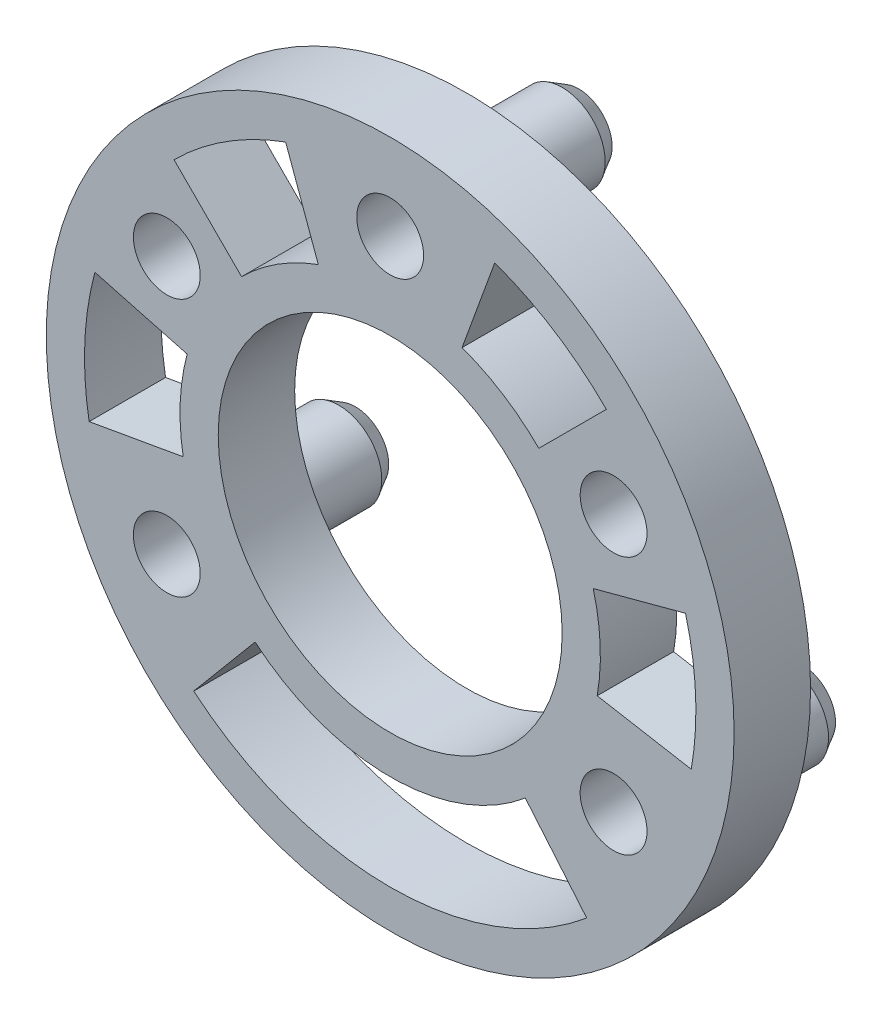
ISO-10303-21;
HEADER;
FILE_DESCRIPTION(('STEP AP214'),'2;1');
FILE_NAME('part.step','',(''),(''),'','','');
FILE_SCHEMA(('AUTOMOTIVE_DESIGN { 1 0 10303 214 1 1 1 1 }'));
ENDSEC;
DATA;
#1=APPLICATION_CONTEXT('core data for automotive mechanical design processes');
#2=APPLICATION_PROTOCOL_DEFINITION('international standard','automotive_design',2000,#1);
#3=PRODUCT_CONTEXT('',#1,'mechanical');
#4=PRODUCT('Part','Part','',(#3));
#5=PRODUCT_RELATED_PRODUCT_CATEGORY('part','',(#4));
#6=PRODUCT_DEFINITION_FORMATION('','',#4);
#7=PRODUCT_DEFINITION_CONTEXT('part definition',#1,'design');
#8=PRODUCT_DEFINITION('design','',#6,#7);
#9=PRODUCT_DEFINITION_SHAPE('','',#8);
#10=(LENGTH_UNIT() NAMED_UNIT(*) SI_UNIT(.MILLI.,.METRE.));
#11=(NAMED_UNIT(*) PLANE_ANGLE_UNIT() SI_UNIT($,.RADIAN.));
#12=(NAMED_UNIT(*) SI_UNIT($,.STERADIAN.) SOLID_ANGLE_UNIT());
#13=UNCERTAINTY_MEASURE_WITH_UNIT(LENGTH_MEASURE(1.E-05),#10,'distance_accuracy_value','');
#14=(GEOMETRIC_REPRESENTATION_CONTEXT(3) GLOBAL_UNCERTAINTY_ASSIGNED_CONTEXT((#13)) GLOBAL_UNIT_ASSIGNED_CONTEXT((#10,
#11,#12)) REPRESENTATION_CONTEXT('',''));
#15=CARTESIAN_POINT('',(0.,0.,0.));
#16=DIRECTION('',(0.,0.,1.));
#17=DIRECTION('',(1.,0.,0.));
#18=AXIS2_PLACEMENT_3D('',#15,#16,#17);
#19=CARTESIAN_POINT('',(0.,0.,4.));
#20=DIRECTION('',(0.,0.,-1.));
#21=DIRECTION('',(-1.,0.,0.));
#22=AXIS2_PLACEMENT_3D('',#19,#20,#21);
#23=CYLINDRICAL_SURFACE('',#22,11.);
#24=CARTESIAN_POINT('',(0.,0.,0.));
#25=DIRECTION('',(0.,0.,-1.));
#26=DIRECTION('',(-1.,0.,0.));
#27=AXIS2_PLACEMENT_3D('',#24,#25,#26);
#28=CIRCLE('',#27,11.);
#29=CARTESIAN_POINT('',(10.6251840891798,2.8470094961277,0.));
#30=VERTEX_POINT('',#29);
#31=CARTESIAN_POINT('',(10.8328852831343,-1.91012995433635,0.));
#32=VERTEX_POINT('',#31);
#33=EDGE_CURVE('E552',#30,#32,#28,.T.);
#34=ORIENTED_EDGE('',*,*,#33,.F.);
#35=DIRECTION('',(0.,0.,1.));
#36=VECTOR('',#35,1.);
#37=CARTESIAN_POINT('',(10.6251840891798,2.8470094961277,-11.4287257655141));
#38=LINE('',#37,#36);
#39=CARTESIAN_POINT('',(10.6251840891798,2.8470094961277,4.));
#40=VERTEX_POINT('',#39);
#41=EDGE_CURVE('E61',#30,#40,#38,.T.);
#42=ORIENTED_EDGE('',*,*,#41,.T.);
#43=CARTESIAN_POINT('',(0.,0.,4.));
#44=DIRECTION('',(0.,0.,-1.));
#45=DIRECTION('',(-1.,0.,0.));
#46=AXIS2_PLACEMENT_3D('',#43,#44,#45);
#47=CIRCLE('',#46,11.);
#48=CARTESIAN_POINT('',(10.8328852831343,-1.91012995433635,4.));
#49=VERTEX_POINT('',#48);
#50=EDGE_CURVE('E213',#40,#49,#47,.T.);
#51=ORIENTED_EDGE('',*,*,#50,.T.);
#52=DIRECTION('',(0.,0.,-1.));
#53=VECTOR('',#52,1.);
#54=CARTESIAN_POINT('',(10.8328852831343,-1.91012995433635,4.));
#55=LINE('',#54,#53);
#56=EDGE_CURVE('E230',#49,#32,#55,.T.);
#57=ORIENTED_EDGE('',*,*,#56,.T.);
#58=EDGE_LOOP('',(#34,#42,#51,#57));
#59=FACE_BOUND('',#58,.T.);
#60=ADVANCED_FACE('F44',(#59),#23,.T.);
#61=CARTESIAN_POINT('',(3.76222157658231,10.336618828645,4.));
#62=VERTEX_POINT('',#61);
#63=CARTESIAN_POINT('',(7.77817459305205,7.77817459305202,4.));
#64=VERTEX_POINT('',#63);
#65=EDGE_CURVE('E553',#62,#64,#47,.T.);
#66=ORIENTED_EDGE('',*,*,#65,.T.);
#67=DIRECTION('',(0.,0.,1.));
#68=VECTOR('',#67,1.);
#69=CARTESIAN_POINT('',(7.77817459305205,7.77817459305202,-11.4287257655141));
#70=LINE('',#69,#68);
#71=CARTESIAN_POINT('',(7.77817459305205,7.77817459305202,0.));
#72=VERTEX_POINT('',#71);
#73=EDGE_CURVE('E467',#72,#64,#70,.T.);
#74=ORIENTED_EDGE('',*,*,#73,.F.);
#75=CARTESIAN_POINT('',(3.76222157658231,10.336618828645,0.));
#76=VERTEX_POINT('',#75);
#77=EDGE_CURVE('E563',#76,#72,#28,.T.);
#78=ORIENTED_EDGE('',*,*,#77,.F.);
#79=DIRECTION('',(0.,0.,-1.));
#80=VECTOR('',#79,1.);
#81=CARTESIAN_POINT('',(3.76222157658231,10.336618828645,4.));
#82=LINE('',#81,#80);
#83=EDGE_CURVE('E218',#62,#76,#82,.T.);
#84=ORIENTED_EDGE('',*,*,#83,.F.);
#85=EDGE_LOOP('',(#66,#74,#78,#84));
#86=FACE_BOUND('',#85,.T.);
#87=ADVANCED_FACE('F355',(#86),#23,.T.);
#88=CARTESIAN_POINT('',(0.,0.,4.));
#89=DIRECTION('',(0.,0.,-1.));
#90=DIRECTION('',(-1.,0.,0.));
#91=AXIS2_PLACEMENT_3D('',#88,#89,#90);
#92=CYLINDRICAL_SURFACE('',#91,16.);
#93=CARTESIAN_POINT('',(0.,0.,4.));
#94=DIRECTION('',(0.,0.,1.));
#95=DIRECTION('',(-1.,0.,0.));
#96=AXIS2_PLACEMENT_3D('',#93,#94,#95);
#97=CIRCLE('',#96,16.);
#98=CARTESIAN_POINT('',(15.7569240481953,-2.77837084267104,4.));
#99=VERTEX_POINT('',#98);
#100=CARTESIAN_POINT('',(15.4548132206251,4.14110472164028,4.));
#101=VERTEX_POINT('',#100);
#102=EDGE_CURVE('E198',#99,#101,#97,.T.);
#103=ORIENTED_EDGE('',*,*,#102,.T.);
#104=DIRECTION('',(0.,0.,1.));
#105=VECTOR('',#104,1.);
#106=CARTESIAN_POINT('',(15.4548132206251,4.14110472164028,-11.4287257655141));
#107=LINE('',#106,#105);
#108=CARTESIAN_POINT('',(15.4548132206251,4.14110472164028,0.));
#109=VERTEX_POINT('',#108);
#110=EDGE_CURVE('E183',#109,#101,#107,.T.);
#111=ORIENTED_EDGE('',*,*,#110,.F.);
#112=CARTESIAN_POINT('',(0.,0.,0.));
#113=DIRECTION('',(0.,0.,1.));
#114=DIRECTION('',(-1.,0.,0.));
#115=AXIS2_PLACEMENT_3D('',#112,#113,#114);
#116=CIRCLE('',#115,16.);
#117=CARTESIAN_POINT('',(15.7569240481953,-2.77837084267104,0.));
#118=VERTEX_POINT('',#117);
#119=EDGE_CURVE('E195',#118,#109,#116,.T.);
#120=ORIENTED_EDGE('',*,*,#119,.F.);
#121=DIRECTION('',(0.,0.,-1.));
#122=VECTOR('',#121,1.);
#123=CARTESIAN_POINT('',(15.7569240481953,-2.77837084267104,4.));
#124=LINE('',#123,#122);
#125=EDGE_CURVE('E227',#99,#118,#124,.T.);
#126=ORIENTED_EDGE('',*,*,#125,.F.);
#127=EDGE_LOOP('',(#103,#111,#120,#126));
#128=FACE_BOUND('',#127,.T.);
#129=ADVANCED_FACE('F193',(#128),#92,.F.);
#130=CARTESIAN_POINT('',(11.3137084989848,11.3137084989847,0.));
#131=VERTEX_POINT('',#130);
#132=CARTESIAN_POINT('',(5.47232229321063,15.0350819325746,0.));
#133=VERTEX_POINT('',#132);
#134=EDGE_CURVE('E208',#131,#133,#116,.T.);
#135=ORIENTED_EDGE('',*,*,#134,.F.);
#136=DIRECTION('',(0.,0.,1.));
#137=VECTOR('',#136,1.);
#138=CARTESIAN_POINT('',(11.3137084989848,11.3137084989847,-11.4287257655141));
#139=LINE('',#138,#137);
#140=CARTESIAN_POINT('',(11.3137084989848,11.3137084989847,4.));
#141=VERTEX_POINT('',#140);
#142=EDGE_CURVE('E69',#131,#141,#139,.T.);
#143=ORIENTED_EDGE('',*,*,#142,.T.);
#144=CARTESIAN_POINT('',(5.47232229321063,15.0350819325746,4.));
#145=VERTEX_POINT('',#144);
#146=EDGE_CURVE('E559',#141,#145,#97,.T.);
#147=ORIENTED_EDGE('',*,*,#146,.T.);
#148=DIRECTION('',(0.,0.,-1.));
#149=VECTOR('',#148,1.);
#150=CARTESIAN_POINT('',(5.47232229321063,15.0350819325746,4.));
#151=LINE('',#150,#149);
#152=EDGE_CURVE('E222',#145,#133,#151,.T.);
#153=ORIENTED_EDGE('',*,*,#152,.T.);
#154=EDGE_LOOP('',(#135,#143,#147,#153));
#155=FACE_BOUND('',#154,.T.);
#156=ADVANCED_FACE('F632',(#155),#92,.F.);
#157=CARTESIAN_POINT('',(0.,0.,4.));
#158=DIRECTION('',(0.,0.,-1.));
#159=DIRECTION('',(-1.,0.,0.));
#160=AXIS2_PLACEMENT_3D('',#157,#158,#159);
#161=CYLINDRICAL_SURFACE('',#160,11.);
#162=DIRECTION('',(0.,0.,1.));
#163=VECTOR('',#162,1.);
#164=CARTESIAN_POINT('',(-10.6251840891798,2.8470094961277,-11.4287257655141));
#165=LINE('',#164,#163);
#166=CARTESIAN_POINT('',(-10.6251840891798,2.8470094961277,0.));
#167=VERTEX_POINT('',#166);
#168=CARTESIAN_POINT('',(-10.6251840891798,2.8470094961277,4.));
#169=VERTEX_POINT('',#168);
#170=EDGE_CURVE('E501',#167,#169,#165,.T.);
#171=ORIENTED_EDGE('',*,*,#170,.F.);
#172=CARTESIAN_POINT('',(0.,0.,0.));
#173=DIRECTION('',(0.,0.,-1.));
#174=DIRECTION('',(-1.,0.,0.));
#175=AXIS2_PLACEMENT_3D('',#172,#173,#174);
#176=CIRCLE('',#175,11.);
#177=CARTESIAN_POINT('',(-10.8328852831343,-1.91012995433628,0.));
#178=VERTEX_POINT('',#177);
#179=EDGE_CURVE('E252',#178,#167,#176,.T.);
#180=ORIENTED_EDGE('',*,*,#179,.F.);
#181=DIRECTION('',(0.,0.,-1.));
#182=VECTOR('',#181,1.);
#183=CARTESIAN_POINT('',(-10.8328852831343,-1.91012995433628,4.));
#184=LINE('',#183,#182);
#185=CARTESIAN_POINT('',(-10.8328852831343,-1.91012995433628,4.));
#186=VERTEX_POINT('',#185);
#187=EDGE_CURVE('E251',#186,#178,#184,.T.);
#188=ORIENTED_EDGE('',*,*,#187,.F.);
#189=CARTESIAN_POINT('',(0.,0.,4.));
#190=DIRECTION('',(0.,0.,-1.));
#191=DIRECTION('',(-1.,0.,0.));
#192=AXIS2_PLACEMENT_3D('',#189,#190,#191);
#193=CIRCLE('',#192,11.);
#194=EDGE_CURVE('E235',#186,#169,#193,.T.);
#195=ORIENTED_EDGE('',*,*,#194,.T.);
#196=EDGE_LOOP('',(#171,#180,#188,#195));
#197=FACE_BOUND('',#196,.T.);
#198=ADVANCED_FACE('F384',(#197),#161,.T.);
#199=CARTESIAN_POINT('',(0.,0.,4.));
#200=DIRECTION('',(0.,0.,-1.));
#201=DIRECTION('',(-1.,0.,0.));
#202=AXIS2_PLACEMENT_3D('',#199,#200,#201);
#203=CYLINDRICAL_SURFACE('',#202,16.);
#204=DIRECTION('',(0.,0.,1.));
#205=VECTOR('',#204,1.);
#206=CARTESIAN_POINT('',(-15.4548132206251,4.14110472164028,-11.4287257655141));
#207=LINE('',#206,#205);
#208=CARTESIAN_POINT('',(-15.4548132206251,4.14110472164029,0.));
#209=VERTEX_POINT('',#208);
#210=CARTESIAN_POINT('',(-15.4548132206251,4.14110472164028,4.));
#211=VERTEX_POINT('',#210);
#212=EDGE_CURVE('E494',#209,#211,#207,.T.);
#213=ORIENTED_EDGE('',*,*,#212,.T.);
#214=CARTESIAN_POINT('',(0.,0.,4.));
#215=DIRECTION('',(0.,0.,1.));
#216=DIRECTION('',(-1.,0.,0.));
#217=AXIS2_PLACEMENT_3D('',#214,#215,#216);
#218=CIRCLE('',#217,16.);
#219=CARTESIAN_POINT('',(-15.7569240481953,-2.77837084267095,4.));
#220=VERTEX_POINT('',#219);
#221=EDGE_CURVE('E243',#211,#220,#218,.T.);
#222=ORIENTED_EDGE('',*,*,#221,.T.);
#223=DIRECTION('',(0.,0.,-1.));
#224=VECTOR('',#223,1.);
#225=CARTESIAN_POINT('',(-15.7569240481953,-2.77837084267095,4.));
#226=LINE('',#225,#224);
#227=CARTESIAN_POINT('',(-15.7569240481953,-2.77837084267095,0.));
#228=VERTEX_POINT('',#227);
#229=EDGE_CURVE('E272',#220,#228,#226,.T.);
#230=ORIENTED_EDGE('',*,*,#229,.T.);
#231=CARTESIAN_POINT('',(0.,0.,0.));
#232=DIRECTION('',(0.,0.,1.));
#233=DIRECTION('',(-1.,0.,0.));
#234=AXIS2_PLACEMENT_3D('',#231,#232,#233);
#235=CIRCLE('',#234,16.);
#236=EDGE_CURVE('E260',#209,#228,#235,.T.);
#237=ORIENTED_EDGE('',*,*,#236,.F.);
#238=EDGE_LOOP('',(#213,#222,#230,#237));
#239=FACE_BOUND('',#238,.T.);
#240=ADVANCED_FACE('F375',(#239),#203,.F.);
#241=CARTESIAN_POINT('',(0.,0.,0.));
#242=DIRECTION('',(0.,0.,1.));
#243=DIRECTION('',(1.,0.,0.));
#244=AXIS2_PLACEMENT_3D('',#241,#242,#243);
#245=PLANE('',#244);
#246=DIRECTION('',(0.965925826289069,0.258819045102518,0.));
#247=VECTOR('',#246,1.);
#248=CARTESIAN_POINT('',(15.4548132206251,4.14110472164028,0.));
#249=LINE('',#248,#247);
#250=EDGE_CURVE('E180',#30,#109,#249,.T.);
#251=ORIENTED_EDGE('',*,*,#250,.F.);
#252=ORIENTED_EDGE('',*,*,#33,.T.);
#253=DIRECTION('',(0.984807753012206,-0.173648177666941,0.));
#254=VECTOR('',#253,1.);
#255=CARTESIAN_POINT('',(15.7569240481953,-2.77837084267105,0.));
#256=LINE('',#255,#254);
#257=EDGE_CURVE('E205',#32,#118,#256,.T.);
#258=ORIENTED_EDGE('',*,*,#257,.T.);
#259=ORIENTED_EDGE('',*,*,#119,.T.);
#260=EDGE_LOOP('',(#251,#252,#258,#259));
#261=FACE_BOUND('',#260,.T.);
#262=ORIENTED_EDGE('',*,*,#179,.T.);
#263=DIRECTION('',(-0.965925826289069,0.258819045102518,0.));
#264=VECTOR('',#263,1.);
#265=CARTESIAN_POINT('',(-15.4548132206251,4.14110472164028,0.));
#266=LINE('',#265,#264);
#267=EDGE_CURVE('E476',#167,#209,#266,.T.);
#268=ORIENTED_EDGE('',*,*,#267,.T.);
#269=ORIENTED_EDGE('',*,*,#236,.T.);
#270=DIRECTION('',(0.984807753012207,0.173648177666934,0.));
#271=VECTOR('',#270,1.);
#272=CARTESIAN_POINT('',(-10.8328852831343,-1.91012995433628,0.));
#273=LINE('',#272,#271);
#274=EDGE_CURVE('E265',#228,#178,#273,.T.);
#275=ORIENTED_EDGE('',*,*,#274,.T.);
#276=EDGE_LOOP('',(#262,#268,#269,#275));
#277=FACE_BOUND('',#276,.T.);
#278=CARTESIAN_POINT('',(11.6913429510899,-6.75000000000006,0.));
#279=DIRECTION('',(0.,0.,1.));
#280=DIRECTION('',(1.,0.,0.));
#281=AXIS2_PLACEMENT_3D('',#278,#279,#280);
#282=CIRCLE('',#281,2.25);
#283=CARTESIAN_POINT('',(13.9413429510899,-6.75000000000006,0.));
#284=VERTEX_POINT('',#283);
#285=EDGE_CURVE('E315',#284,#284,#282,.F.);
#286=ORIENTED_EDGE('',*,*,#285,.F.);
#287=EDGE_LOOP('',(#286));
#288=FACE_BOUND('',#287,.T.);
#289=CARTESIAN_POINT('',(0.,0.,0.));
#290=DIRECTION('',(0.,0.,-1.));
#291=DIRECTION('',(-1.,0.,0.));
#292=AXIS2_PLACEMENT_3D('',#289,#290,#291);
#293=CIRCLE('',#292,11.);
#294=CARTESIAN_POINT('',(7.07066370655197,-8.42648887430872,0.));
#295=VERTEX_POINT('',#294);
#296=CARTESIAN_POINT('',(-7.07066370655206,-8.42648887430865,0.));
#297=VERTEX_POINT('',#296);
#298=EDGE_CURVE('E510',#295,#297,#293,.T.);
#299=ORIENTED_EDGE('',*,*,#298,.T.);
#300=DIRECTION('',(-0.642787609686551,-0.766044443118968,0.));
#301=VECTOR('',#300,1.);
#302=CARTESIAN_POINT('',(-10.2846017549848,-12.2567110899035,0.));
#303=LINE('',#302,#301);
#304=CARTESIAN_POINT('',(-10.2846017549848,-12.2567110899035,0.));
#305=VERTEX_POINT('',#304);
#306=EDGE_CURVE('E528',#297,#305,#303,.T.);
#307=ORIENTED_EDGE('',*,*,#306,.T.);
#308=CARTESIAN_POINT('',(0.,0.,0.));
#309=DIRECTION('',(0.,0.,1.));
#310=DIRECTION('',(-1.,0.,0.));
#311=AXIS2_PLACEMENT_3D('',#308,#309,#310);
#312=CIRCLE('',#311,16.);
#313=CARTESIAN_POINT('',(10.2846017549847,-12.2567110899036,0.));
#314=VERTEX_POINT('',#313);
#315=EDGE_CURVE('E532',#305,#314,#312,.T.);
#316=ORIENTED_EDGE('',*,*,#315,.T.);
#317=DIRECTION('',(-0.642787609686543,0.766044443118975,0.));
#318=VECTOR('',#317,1.);
#319=CARTESIAN_POINT('',(7.07066370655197,-8.42648887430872,0.));
#320=LINE('',#319,#318);
#321=EDGE_CURVE('E514',#314,#295,#320,.T.);
#322=ORIENTED_EDGE('',*,*,#321,.T.);
#323=EDGE_LOOP('',(#299,#307,#316,#322));
#324=FACE_BOUND('',#323,.T.);
#325=DIRECTION('',(0.707106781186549,-0.707106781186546,0.));
#326=VECTOR('',#325,1.);
#327=CARTESIAN_POINT('',(-11.3137084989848,11.3137084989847,0.));
#328=LINE('',#327,#326);
#329=CARTESIAN_POINT('',(-11.3137084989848,11.3137084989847,0.));
#330=VERTEX_POINT('',#329);
#331=CARTESIAN_POINT('',(-7.77817459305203,7.778174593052,0.));
#332=VERTEX_POINT('',#331);
#333=EDGE_CURVE('E481',#330,#332,#328,.T.);
#334=ORIENTED_EDGE('',*,*,#333,.T.);
#335=CARTESIAN_POINT('',(-3.76222157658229,10.336618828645,0.));
#336=VERTEX_POINT('',#335);
#337=EDGE_CURVE('E234',#332,#336,#176,.T.);
#338=ORIENTED_EDGE('',*,*,#337,.T.);
#339=DIRECTION('',(-0.342020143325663,0.93969262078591,0.));
#340=VECTOR('',#339,1.);
#341=CARTESIAN_POINT('',(-5.47232229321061,15.0350819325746,0.));
#342=LINE('',#341,#340);
#343=CARTESIAN_POINT('',(-5.47232229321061,15.0350819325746,0.));
#344=VERTEX_POINT('',#343);
#345=EDGE_CURVE('E256',#336,#344,#342,.T.);
#346=ORIENTED_EDGE('',*,*,#345,.T.);
#347=EDGE_CURVE('E261',#344,#330,#235,.T.);
#348=ORIENTED_EDGE('',*,*,#347,.T.);
#349=EDGE_LOOP('',(#334,#338,#346,#348));
#350=FACE_BOUND('',#349,.T.);
#351=CARTESIAN_POINT('',(0.,0.,0.));
#352=DIRECTION('',(0.,0.,1.));
#353=DIRECTION('',(1.,0.,0.));
#354=AXIS2_PLACEMENT_3D('',#351,#352,#353);
#355=CIRCLE('',#354,18.);
#356=CARTESIAN_POINT('',(18.,0.,0.));
#357=VERTEX_POINT('',#356);
#358=EDGE_CURVE('E303',#357,#357,#355,.T.);
#359=ORIENTED_EDGE('',*,*,#358,.F.);
#360=EDGE_LOOP('',(#359));
#361=FACE_BOUND('',#360,.T.);
#362=CARTESIAN_POINT('',(0.,0.,0.));
#363=DIRECTION('',(0.,0.,1.));
#364=DIRECTION('',(1.,0.,0.));
#365=AXIS2_PLACEMENT_3D('',#362,#363,#364);
#366=CIRCLE('',#365,9.);
#367=CARTESIAN_POINT('',(9.,0.,0.));
#368=VERTEX_POINT('',#367);
#369=EDGE_CURVE('E283',#368,#368,#366,.T.);
#370=ORIENTED_EDGE('',*,*,#369,.T.);
#371=EDGE_LOOP('',(#370));
#372=FACE_BOUND('',#371,.T.);
#373=ORIENTED_EDGE('',*,*,#77,.T.);
#374=DIRECTION('',(-0.707106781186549,-0.707106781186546,0.));
#375=VECTOR('',#374,1.);
#376=CARTESIAN_POINT('',(11.3137084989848,11.3137084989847,0.));
#377=LINE('',#376,#375);
#378=EDGE_CURVE('E466',#131,#72,#377,.T.);
#379=ORIENTED_EDGE('',*,*,#378,.F.);
#380=ORIENTED_EDGE('',*,*,#134,.T.);
#381=DIRECTION('',(-0.342020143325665,-0.93969262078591,0.));
#382=VECTOR('',#381,1.);
#383=CARTESIAN_POINT('',(3.76222157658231,10.336618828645,0.));
#384=LINE('',#383,#382);
#385=EDGE_CURVE('E207',#133,#76,#384,.T.);
#386=ORIENTED_EDGE('',*,*,#385,.T.);
#387=EDGE_LOOP('',(#373,#379,#380,#386));
#388=FACE_BOUND('',#387,.T.);
#389=CARTESIAN_POINT('',(0.,13.5,0.));
#390=DIRECTION('',(0.,0.,1.));
#391=DIRECTION('',(1.,0.,0.));
#392=AXIS2_PLACEMENT_3D('',#389,#390,#391);
#393=CIRCLE('',#392,2.25);
#394=CARTESIAN_POINT('',(2.25,13.5,0.));
#395=VERTEX_POINT('',#394);
#396=EDGE_CURVE('E308',#395,#395,#393,.F.);
#397=ORIENTED_EDGE('',*,*,#396,.F.);
#398=EDGE_LOOP('',(#397));
#399=FACE_BOUND('',#398,.T.);
#400=CARTESIAN_POINT('',(-11.6913429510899,-6.75000000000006,0.));
#401=DIRECTION('',(0.,0.,1.));
#402=DIRECTION('',(1.,0.,0.));
#403=AXIS2_PLACEMENT_3D('',#400,#401,#402);
#404=CIRCLE('',#403,2.25);
#405=CARTESIAN_POINT('',(-9.44134295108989,-6.75000000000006,0.));
#406=VERTEX_POINT('',#405);
#407=EDGE_CURVE('E319',#406,#406,#404,.F.);
#408=ORIENTED_EDGE('',*,*,#407,.F.);
#409=EDGE_LOOP('',(#408));
#410=FACE_BOUND('',#409,.T.);
#411=CARTESIAN_POINT('',(-11.6913429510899,6.74999999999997,0.));
#412=DIRECTION('',(0.,0.,1.));
#413=DIRECTION('',(1.,0.,0.));
#414=AXIS2_PLACEMENT_3D('',#411,#412,#413);
#415=CIRCLE('',#414,1.75);
#416=CARTESIAN_POINT('',(-9.94134295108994,6.74999999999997,0.));
#417=VERTEX_POINT('',#416);
#418=EDGE_CURVE('E480',#417,#417,#415,.F.);
#419=ORIENTED_EDGE('',*,*,#418,.F.);
#420=EDGE_LOOP('',(#419));
#421=FACE_BOUND('',#420,.T.);
#422=CARTESIAN_POINT('',(11.6913429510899,6.74999999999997,0.));
#423=DIRECTION('',(0.,0.,1.));
#424=DIRECTION('',(1.,0.,0.));
#425=AXIS2_PLACEMENT_3D('',#422,#423,#424);
#426=CIRCLE('',#425,1.75);
#427=CARTESIAN_POINT('',(13.4413429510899,6.74999999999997,0.));
#428=VERTEX_POINT('',#427);
#429=EDGE_CURVE('E472',#428,#428,#426,.T.);
#430=ORIENTED_EDGE('',*,*,#429,.T.);
#431=EDGE_LOOP('',(#430));
#432=FACE_BOUND('',#431,.T.);
#433=ADVANCED_FACE('F202',(#261,#277,#288,#324,#350,#361,#372,#388,#399,#410,#421,#432),#245,.F.);
#434=CARTESIAN_POINT('',(0.,0.,4.));
#435=DIRECTION('',(0.,0.,1.));
#436=DIRECTION('',(1.,0.,0.));
#437=AXIS2_PLACEMENT_3D('',#434,#435,#436);
#438=PLANE('',#437);
#439=DIRECTION('',(0.707106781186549,0.707106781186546,0.));
#440=VECTOR('',#439,1.);
#441=CARTESIAN_POINT('',(11.3137084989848,11.3137084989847,4.));
#442=LINE('',#441,#440);
#443=EDGE_CURVE('E461',#64,#141,#442,.T.);
#444=ORIENTED_EDGE('',*,*,#443,.F.);
#445=ORIENTED_EDGE('',*,*,#65,.F.);
#446=DIRECTION('',(-0.342020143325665,-0.93969262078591,0.));
#447=VECTOR('',#446,1.);
#448=CARTESIAN_POINT('',(3.76222157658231,10.336618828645,4.));
#449=LINE('',#448,#447);
#450=EDGE_CURVE('E223',#145,#62,#449,.T.);
#451=ORIENTED_EDGE('',*,*,#450,.F.);
#452=ORIENTED_EDGE('',*,*,#146,.F.);
#453=EDGE_LOOP('',(#444,#445,#451,#452));
#454=FACE_BOUND('',#453,.T.);
#455=CARTESIAN_POINT('',(-7.77817459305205,7.77817459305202,4.));
#456=VERTEX_POINT('',#455);
#457=CARTESIAN_POINT('',(-3.76222157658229,10.336618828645,4.));
#458=VERTEX_POINT('',#457);
#459=EDGE_CURVE('E240',#456,#458,#193,.T.);
#460=ORIENTED_EDGE('',*,*,#459,.F.);
#461=DIRECTION('',(-0.707106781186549,0.707106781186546,0.));
#462=VECTOR('',#461,1.);
#463=CARTESIAN_POINT('',(-11.3137084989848,11.3137084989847,4.));
#464=LINE('',#463,#462);
#465=CARTESIAN_POINT('',(-11.3137084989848,11.3137084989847,4.));
#466=VERTEX_POINT('',#465);
#467=EDGE_CURVE('E490',#456,#466,#464,.T.);
#468=ORIENTED_EDGE('',*,*,#467,.T.);
#469=CARTESIAN_POINT('',(-5.47232229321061,15.0350819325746,4.));
#470=VERTEX_POINT('',#469);
#471=EDGE_CURVE('E244',#470,#466,#218,.T.);
#472=ORIENTED_EDGE('',*,*,#471,.F.);
#473=DIRECTION('',(-0.342020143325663,0.93969262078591,0.));
#474=VECTOR('',#473,1.);
#475=CARTESIAN_POINT('',(-5.47232229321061,15.0350819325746,4.));
#476=LINE('',#475,#474);
#477=EDGE_CURVE('E239',#458,#470,#476,.T.);
#478=ORIENTED_EDGE('',*,*,#477,.F.);
#479=EDGE_LOOP('',(#460,#468,#472,#478));
#480=FACE_BOUND('',#479,.T.);
#481=CARTESIAN_POINT('',(11.6913429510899,-6.75000000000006,4.));
#482=DIRECTION('',(0.,0.,1.));
#483=DIRECTION('',(1.,0.,0.));
#484=AXIS2_PLACEMENT_3D('',#481,#482,#483);
#485=CIRCLE('',#484,1.75);
#486=CARTESIAN_POINT('',(13.4413429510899,-6.75000000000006,4.));
#487=VERTEX_POINT('',#486);
#488=EDGE_CURVE('E288',#487,#487,#485,.T.);
#489=ORIENTED_EDGE('',*,*,#488,.F.);
#490=EDGE_LOOP('',(#489));
#491=FACE_BOUND('',#490,.T.);
#492=CARTESIAN_POINT('',(0.,13.5,4.));
#493=DIRECTION('',(0.,0.,1.));
#494=DIRECTION('',(1.,0.,0.));
#495=AXIS2_PLACEMENT_3D('',#492,#493,#494);
#496=CIRCLE('',#495,1.75);
#497=CARTESIAN_POINT('',(1.75,13.5,4.));
#498=VERTEX_POINT('',#497);
#499=EDGE_CURVE('E299',#498,#498,#496,.T.);
#500=ORIENTED_EDGE('',*,*,#499,.F.);
#501=EDGE_LOOP('',(#500));
#502=FACE_BOUND('',#501,.T.);
#503=CARTESIAN_POINT('',(0.,0.,4.));
#504=DIRECTION('',(0.,0.,1.));
#505=DIRECTION('',(1.,0.,0.));
#506=AXIS2_PLACEMENT_3D('',#503,#504,#505);
#507=CIRCLE('',#506,18.);
#508=CARTESIAN_POINT('',(18.,0.,4.));
#509=VERTEX_POINT('',#508);
#510=EDGE_CURVE('E304',#509,#509,#507,.T.);
#511=ORIENTED_EDGE('',*,*,#510,.T.);
#512=EDGE_LOOP('',(#511));
#513=FACE_BOUND('',#512,.T.);
#514=CARTESIAN_POINT('',(-11.6913429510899,-6.75000000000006,4.));
#515=DIRECTION('',(0.,0.,1.));
#516=DIRECTION('',(1.,0.,0.));
#517=AXIS2_PLACEMENT_3D('',#514,#515,#516);
#518=CIRCLE('',#517,1.75);
#519=CARTESIAN_POINT('',(-9.94134295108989,-6.75000000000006,4.));
#520=VERTEX_POINT('',#519);
#521=EDGE_CURVE('E295',#520,#520,#518,.T.);
#522=ORIENTED_EDGE('',*,*,#521,.F.);
#523=EDGE_LOOP('',(#522));
#524=FACE_BOUND('',#523,.T.);
#525=CARTESIAN_POINT('',(0.,0.,4.));
#526=DIRECTION('',(0.,0.,1.));
#527=DIRECTION('',(1.,0.,0.));
#528=AXIS2_PLACEMENT_3D('',#525,#526,#527);
#529=CIRCLE('',#528,9.);
#530=CARTESIAN_POINT('',(9.,0.,4.));
#531=VERTEX_POINT('',#530);
#532=EDGE_CURVE('E284',#531,#531,#529,.T.);
#533=ORIENTED_EDGE('',*,*,#532,.F.);
#534=EDGE_LOOP('',(#533));
#535=FACE_BOUND('',#534,.T.);
#536=DIRECTION('',(0.965925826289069,-0.258819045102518,0.));
#537=VECTOR('',#536,1.);
#538=CARTESIAN_POINT('',(-15.4548132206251,4.14110472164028,4.));
#539=LINE('',#538,#537);
#540=EDGE_CURVE('E438',#211,#169,#539,.T.);
#541=ORIENTED_EDGE('',*,*,#540,.T.);
#542=ORIENTED_EDGE('',*,*,#194,.F.);
#543=DIRECTION('',(0.984807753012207,0.173648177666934,0.));
#544=VECTOR('',#543,1.);
#545=CARTESIAN_POINT('',(-10.8328852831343,-1.91012995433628,4.));
#546=LINE('',#545,#544);
#547=EDGE_CURVE('E248',#220,#186,#546,.T.);
#548=ORIENTED_EDGE('',*,*,#547,.F.);
#549=ORIENTED_EDGE('',*,*,#221,.F.);
#550=EDGE_LOOP('',(#541,#542,#548,#549));
#551=FACE_BOUND('',#550,.T.);
#552=DIRECTION('',(0.984807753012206,-0.173648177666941,0.));
#553=VECTOR('',#552,1.);
#554=CARTESIAN_POINT('',(15.7569240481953,-2.77837084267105,4.));
#555=LINE('',#554,#553);
#556=EDGE_CURVE('E442',#49,#99,#555,.T.);
#557=ORIENTED_EDGE('',*,*,#556,.F.);
#558=ORIENTED_EDGE('',*,*,#50,.F.);
#559=DIRECTION('',(-0.965925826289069,-0.258819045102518,0.));
#560=VECTOR('',#559,1.);
#561=CARTESIAN_POINT('',(15.4548132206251,4.14110472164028,4.));
#562=LINE('',#561,#560);
#563=EDGE_CURVE('E200',#101,#40,#562,.T.);
#564=ORIENTED_EDGE('',*,*,#563,.F.);
#565=ORIENTED_EDGE('',*,*,#102,.F.);
#566=EDGE_LOOP('',(#557,#558,#564,#565));
#567=FACE_BOUND('',#566,.T.);
#568=DIRECTION('',(-0.642787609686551,-0.766044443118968,0.));
#569=VECTOR('',#568,1.);
#570=CARTESIAN_POINT('',(-10.2846017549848,-12.2567110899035,4.));
#571=LINE('',#570,#569);
#572=CARTESIAN_POINT('',(-7.07066370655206,-8.42648887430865,4.));
#573=VERTEX_POINT('',#572);
#574=CARTESIAN_POINT('',(-10.2846017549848,-12.2567110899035,4.));
#575=VERTEX_POINT('',#574);
#576=EDGE_CURVE('E447',#573,#575,#571,.T.);
#577=ORIENTED_EDGE('',*,*,#576,.F.);
#578=CARTESIAN_POINT('',(0.,0.,4.));
#579=DIRECTION('',(0.,0.,-1.));
#580=DIRECTION('',(-1.,0.,0.));
#581=AXIS2_PLACEMENT_3D('',#578,#579,#580);
#582=CIRCLE('',#581,11.);
#583=CARTESIAN_POINT('',(7.07066370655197,-8.42648887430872,4.));
#584=VERTEX_POINT('',#583);
#585=EDGE_CURVE('E511',#584,#573,#582,.T.);
#586=ORIENTED_EDGE('',*,*,#585,.F.);
#587=DIRECTION('',(-0.642787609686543,0.766044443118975,0.));
#588=VECTOR('',#587,1.);
#589=CARTESIAN_POINT('',(7.07066370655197,-8.42648887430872,4.));
#590=LINE('',#589,#588);
#591=CARTESIAN_POINT('',(10.2846017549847,-12.2567110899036,4.));
#592=VERTEX_POINT('',#591);
#593=EDGE_CURVE('E521',#592,#584,#590,.T.);
#594=ORIENTED_EDGE('',*,*,#593,.F.);
#595=CARTESIAN_POINT('',(0.,0.,4.));
#596=DIRECTION('',(0.,0.,1.));
#597=DIRECTION('',(-1.,0.,0.));
#598=AXIS2_PLACEMENT_3D('',#595,#596,#597);
#599=CIRCLE('',#598,16.);
#600=EDGE_CURVE('E517',#575,#592,#599,.T.);
#601=ORIENTED_EDGE('',*,*,#600,.F.);
#602=EDGE_LOOP('',(#577,#586,#594,#601));
#603=FACE_BOUND('',#602,.T.);
#604=CARTESIAN_POINT('',(-11.6913429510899,6.74999999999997,4.));
#605=DIRECTION('',(0.,0.,1.));
#606=DIRECTION('',(1.,0.,0.));
#607=AXIS2_PLACEMENT_3D('',#604,#605,#606);
#608=CIRCLE('',#607,1.75);
#609=CARTESIAN_POINT('',(-9.94134295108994,6.74999999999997,4.));
#610=VERTEX_POINT('',#609);
#611=EDGE_CURVE('E451',#610,#610,#608,.T.);
#612=ORIENTED_EDGE('',*,*,#611,.F.);
#613=EDGE_LOOP('',(#612));
#614=FACE_BOUND('',#613,.T.);
#615=CARTESIAN_POINT('',(11.6913429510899,6.74999999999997,4.));
#616=DIRECTION('',(0.,0.,-1.));
#617=DIRECTION('',(-1.,0.,0.));
#618=AXIS2_PLACEMENT_3D('',#615,#616,#617);
#619=CIRCLE('',#618,1.75);
#620=CARTESIAN_POINT('',(9.94134295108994,6.74999999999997,4.));
#621=VERTEX_POINT('',#620);
#622=EDGE_CURVE('E454',#621,#621,#619,.T.);
#623=ORIENTED_EDGE('',*,*,#622,.T.);
#624=EDGE_LOOP('',(#623));
#625=FACE_BOUND('',#624,.T.);
#626=ADVANCED_FACE('F399',(#454,#480,#491,#502,#513,#524,#535,#551,#567,#603,#614,#625),#438,.T.);
#627=CARTESIAN_POINT('',(0.,0.,4.));
#628=DIRECTION('',(0.,0.,-1.));
#629=DIRECTION('',(-1.,0.,0.));
#630=AXIS2_PLACEMENT_3D('',#627,#628,#629);
#631=CYLINDRICAL_SURFACE('',#630,18.);
#632=ORIENTED_EDGE('',*,*,#510,.F.);
#633=EDGE_LOOP('',(#632));
#634=FACE_BOUND('',#633,.T.);
#635=ORIENTED_EDGE('',*,*,#358,.T.);
#636=EDGE_LOOP('',(#635));
#637=FACE_BOUND('',#636,.T.);
#638=ADVANCED_FACE('F398',(#634,#637),#631,.T.);
#639=CARTESIAN_POINT('',(0.,13.5,4.));
#640=DIRECTION('',(0.,0.,-1.));
#641=DIRECTION('',(-1.,0.,0.));
#642=AXIS2_PLACEMENT_3D('',#639,#640,#641);
#643=CYLINDRICAL_SURFACE('',#642,1.75);
#644=CARTESIAN_POINT('',(0.,13.5,-5.86602540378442));
#645=DIRECTION('',(0.,0.,1.));
#646=DIRECTION('',(1.,0.,0.));
#647=AXIS2_PLACEMENT_3D('',#644,#645,#646);
#648=CIRCLE('',#647,1.75);
#649=CARTESIAN_POINT('',(1.75,13.5,-5.86602540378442));
#650=VERTEX_POINT('',#649);
#651=EDGE_CURVE('E54',#650,#650,#648,.F.);
#652=ORIENTED_EDGE('',*,*,#651,.T.);
#653=EDGE_LOOP('',(#652));
#654=FACE_BOUND('',#653,.T.);
#655=ORIENTED_EDGE('',*,*,#499,.T.);
#656=EDGE_LOOP('',(#655));
#657=FACE_BOUND('',#656,.T.);
#658=ADVANCED_FACE('F342',(#654,#657),#643,.F.);
#659=CARTESIAN_POINT('',(-11.6913429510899,-6.75000000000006,4.));
#660=DIRECTION('',(0.,0.,-1.));
#661=DIRECTION('',(-1.,0.,0.));
#662=AXIS2_PLACEMENT_3D('',#659,#660,#661);
#663=CYLINDRICAL_SURFACE('',#662,1.75);
#664=CARTESIAN_POINT('',(-11.6913429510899,-6.75000000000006,-5.86602540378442));
#665=DIRECTION('',(0.,0.,1.));
#666=DIRECTION('',(1.,0.,0.));
#667=AXIS2_PLACEMENT_3D('',#664,#665,#666);
#668=CIRCLE('',#667,1.75);
#669=CARTESIAN_POINT('',(-9.94134295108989,-6.75000000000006,-5.86602540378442));
#670=VERTEX_POINT('',#669);
#671=EDGE_CURVE('E323',#670,#670,#668,.F.);
#672=ORIENTED_EDGE('',*,*,#671,.T.);
#673=EDGE_LOOP('',(#672));
#674=FACE_BOUND('',#673,.T.);
#675=ORIENTED_EDGE('',*,*,#521,.T.);
#676=EDGE_LOOP('',(#675));
#677=FACE_BOUND('',#676,.T.);
#678=ADVANCED_FACE('F391',(#674,#677),#663,.F.);
#679=CARTESIAN_POINT('',(11.6913429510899,-6.75000000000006,4.));
#680=DIRECTION('',(0.,0.,-1.));
#681=DIRECTION('',(-1.,0.,0.));
#682=AXIS2_PLACEMENT_3D('',#679,#680,#681);
#683=CYLINDRICAL_SURFACE('',#682,1.75);
#684=CARTESIAN_POINT('',(11.6913429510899,-6.75000000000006,-5.86602540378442));
#685=DIRECTION('',(0.,0.,1.));
#686=DIRECTION('',(1.,0.,0.));
#687=AXIS2_PLACEMENT_3D('',#684,#685,#686);
#688=CIRCLE('',#687,1.75);
#689=CARTESIAN_POINT('',(13.4413429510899,-6.75000000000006,-5.86602540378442));
#690=VERTEX_POINT('',#689);
#691=EDGE_CURVE('E331',#690,#690,#688,.F.);
#692=ORIENTED_EDGE('',*,*,#691,.T.);
#693=EDGE_LOOP('',(#692));
#694=FACE_BOUND('',#693,.T.);
#695=ORIENTED_EDGE('',*,*,#488,.T.);
#696=EDGE_LOOP('',(#695));
#697=FACE_BOUND('',#696,.T.);
#698=ADVANCED_FACE('F387',(#694,#697),#683,.F.);
#699=CARTESIAN_POINT('',(0.,0.,4.));
#700=DIRECTION('',(0.,0.,-1.));
#701=DIRECTION('',(-1.,0.,0.));
#702=AXIS2_PLACEMENT_3D('',#699,#700,#701);
#703=CYLINDRICAL_SURFACE('',#702,9.);
#704=ORIENTED_EDGE('',*,*,#532,.T.);
#705=EDGE_LOOP('',(#704));
#706=FACE_BOUND('',#705,.T.);
#707=ORIENTED_EDGE('',*,*,#369,.F.);
#708=EDGE_LOOP('',(#707));
#709=FACE_BOUND('',#708,.T.);
#710=ADVANCED_FACE('F382',(#706,#709),#703,.F.);
#711=DIRECTION('',(0.,0.,1.));
#712=VECTOR('',#711,1.);
#713=CARTESIAN_POINT('',(-7.77817459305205,7.77817459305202,-11.4287257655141));
#714=LINE('',#713,#712);
#715=EDGE_CURVE('E497',#332,#456,#714,.T.);
#716=ORIENTED_EDGE('',*,*,#715,.T.);
#717=ORIENTED_EDGE('',*,*,#459,.T.);
#718=DIRECTION('',(0.,0.,-1.));
#719=VECTOR('',#718,1.);
#720=CARTESIAN_POINT('',(-3.76222157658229,10.336618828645,4.));
#721=LINE('',#720,#719);
#722=EDGE_CURVE('E279',#458,#336,#721,.T.);
#723=ORIENTED_EDGE('',*,*,#722,.T.);
#724=ORIENTED_EDGE('',*,*,#337,.F.);
#725=EDGE_LOOP('',(#716,#717,#723,#724));
#726=FACE_BOUND('',#725,.T.);
#727=ADVANCED_FACE('F378',(#726),#161,.T.);
#728=CARTESIAN_POINT('',(-5.47232229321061,15.0350819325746,4.));
#729=DIRECTION('',(-0.93969262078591,-0.342020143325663,0.));
#730=DIRECTION('',(0.342020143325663,-0.93969262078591,0.));
#731=AXIS2_PLACEMENT_3D('',#728,#729,#730);
#732=PLANE('',#731);
#733=ORIENTED_EDGE('',*,*,#345,.F.);
#734=ORIENTED_EDGE('',*,*,#722,.F.);
#735=ORIENTED_EDGE('',*,*,#477,.T.);
#736=DIRECTION('',(0.,0.,-1.));
#737=VECTOR('',#736,1.);
#738=CARTESIAN_POINT('',(-5.47232229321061,15.0350819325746,4.));
#739=LINE('',#738,#737);
#740=EDGE_CURVE('E276',#470,#344,#739,.T.);
#741=ORIENTED_EDGE('',*,*,#740,.T.);
#742=EDGE_LOOP('',(#733,#734,#735,#741));
#743=FACE_BOUND('',#742,.T.);
#744=ADVANCED_FACE('F373',(#743),#732,.T.);
#745=DIRECTION('',(0.,0.,1.));
#746=VECTOR('',#745,1.);
#747=CARTESIAN_POINT('',(-11.3137084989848,11.3137084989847,-11.4287257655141));
#748=LINE('',#747,#746);
#749=EDGE_CURVE('E485',#330,#466,#748,.T.);
#750=ORIENTED_EDGE('',*,*,#749,.F.);
#751=ORIENTED_EDGE('',*,*,#347,.F.);
#752=ORIENTED_EDGE('',*,*,#740,.F.);
#753=ORIENTED_EDGE('',*,*,#471,.T.);
#754=EDGE_LOOP('',(#750,#751,#752,#753));
#755=FACE_BOUND('',#754,.T.);
#756=ADVANCED_FACE('F369',(#755),#203,.F.);
#757=CARTESIAN_POINT('',(-10.8328852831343,-1.91012995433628,4.));
#758=DIRECTION('',(-0.173648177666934,0.984807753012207,0.));
#759=DIRECTION('',(-0.984807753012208,-0.173648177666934,0.));
#760=AXIS2_PLACEMENT_3D('',#757,#758,#759);
#761=PLANE('',#760);
#762=ORIENTED_EDGE('',*,*,#274,.F.);
#763=ORIENTED_EDGE('',*,*,#229,.F.);
#764=ORIENTED_EDGE('',*,*,#547,.T.);
#765=ORIENTED_EDGE('',*,*,#187,.T.);
#766=EDGE_LOOP('',(#762,#763,#764,#765));
#767=FACE_BOUND('',#766,.T.);
#768=ADVANCED_FACE('F366',(#767),#761,.T.);
#769=CARTESIAN_POINT('',(15.7569240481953,-2.77837084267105,4.));
#770=DIRECTION('',(0.173648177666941,0.984807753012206,0.));
#771=DIRECTION('',(-0.984807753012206,0.173648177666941,0.));
#772=AXIS2_PLACEMENT_3D('',#769,#770,#771);
#773=PLANE('',#772);
#774=ORIENTED_EDGE('',*,*,#257,.F.);
#775=ORIENTED_EDGE('',*,*,#56,.F.);
#776=ORIENTED_EDGE('',*,*,#556,.T.);
#777=ORIENTED_EDGE('',*,*,#125,.T.);
#778=EDGE_LOOP('',(#774,#775,#776,#777));
#779=FACE_BOUND('',#778,.T.);
#780=ADVANCED_FACE('F364',(#779),#773,.T.);
#781=CARTESIAN_POINT('',(3.76222157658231,10.336618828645,4.));
#782=DIRECTION('',(0.93969262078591,-0.342020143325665,0.));
#783=DIRECTION('',(0.342020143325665,0.93969262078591,0.));
#784=AXIS2_PLACEMENT_3D('',#781,#782,#783);
#785=PLANE('',#784);
#786=ORIENTED_EDGE('',*,*,#385,.F.);
#787=ORIENTED_EDGE('',*,*,#152,.F.);
#788=ORIENTED_EDGE('',*,*,#450,.T.);
#789=ORIENTED_EDGE('',*,*,#83,.T.);
#790=EDGE_LOOP('',(#786,#787,#788,#789));
#791=FACE_BOUND('',#790,.T.);
#792=ADVANCED_FACE('F627',(#791),#785,.T.);
#793=CARTESIAN_POINT('',(0.,0.,4.));
#794=DIRECTION('',(0.,0.,-1.));
#795=DIRECTION('',(-1.,0.,0.));
#796=AXIS2_PLACEMENT_3D('',#793,#794,#795);
#797=CYLINDRICAL_SURFACE('',#796,11.);
#798=ORIENTED_EDGE('',*,*,#298,.F.);
#799=DIRECTION('',(0.,0.,-1.));
#800=VECTOR('',#799,1.);
#801=CARTESIAN_POINT('',(7.07066370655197,-8.42648887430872,4.));
#802=LINE('',#801,#800);
#803=EDGE_CURVE('E524',#584,#295,#802,.T.);
#804=ORIENTED_EDGE('',*,*,#803,.F.);
#805=ORIENTED_EDGE('',*,*,#585,.T.);
#806=DIRECTION('',(0.,0.,-1.));
#807=VECTOR('',#806,1.);
#808=CARTESIAN_POINT('',(-7.07066370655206,-8.42648887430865,4.));
#809=LINE('',#808,#807);
#810=EDGE_CURVE('E548',#573,#297,#809,.T.);
#811=ORIENTED_EDGE('',*,*,#810,.T.);
#812=EDGE_LOOP('',(#798,#804,#805,#811));
#813=FACE_BOUND('',#812,.T.);
#814=ADVANCED_FACE('F623',(#813),#797,.T.);
#815=CARTESIAN_POINT('',(-10.2846017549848,-12.2567110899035,4.));
#816=DIRECTION('',(0.766044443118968,-0.642787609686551,0.));
#817=DIRECTION('',(0.642787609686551,0.766044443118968,0.));
#818=AXIS2_PLACEMENT_3D('',#815,#816,#817);
#819=PLANE('',#818);
#820=ORIENTED_EDGE('',*,*,#306,.F.);
#821=ORIENTED_EDGE('',*,*,#810,.F.);
#822=ORIENTED_EDGE('',*,*,#576,.T.);
#823=DIRECTION('',(0.,0.,-1.));
#824=VECTOR('',#823,1.);
#825=CARTESIAN_POINT('',(-10.2846017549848,-12.2567110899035,4.));
#826=LINE('',#825,#824);
#827=EDGE_CURVE('E545',#575,#305,#826,.T.);
#828=ORIENTED_EDGE('',*,*,#827,.T.);
#829=EDGE_LOOP('',(#820,#821,#822,#828));
#830=FACE_BOUND('',#829,.T.);
#831=ADVANCED_FACE('F619',(#830),#819,.T.);
#832=CARTESIAN_POINT('',(0.,0.,4.));
#833=DIRECTION('',(0.,0.,-1.));
#834=DIRECTION('',(-1.,0.,0.));
#835=AXIS2_PLACEMENT_3D('',#832,#833,#834);
#836=CYLINDRICAL_SURFACE('',#835,16.);
#837=ORIENTED_EDGE('',*,*,#315,.F.);
#838=ORIENTED_EDGE('',*,*,#827,.F.);
#839=ORIENTED_EDGE('',*,*,#600,.T.);
#840=DIRECTION('',(0.,0.,-1.));
#841=VECTOR('',#840,1.);
#842=CARTESIAN_POINT('',(10.2846017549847,-12.2567110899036,4.));
#843=LINE('',#842,#841);
#844=EDGE_CURVE('E542',#592,#314,#843,.T.);
#845=ORIENTED_EDGE('',*,*,#844,.T.);
#846=EDGE_LOOP('',(#837,#838,#839,#845));
#847=FACE_BOUND('',#846,.T.);
#848=ADVANCED_FACE('F615',(#847),#836,.F.);
#849=CARTESIAN_POINT('',(7.07066370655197,-8.42648887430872,4.));
#850=DIRECTION('',(-0.766044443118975,-0.642787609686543,0.));
#851=DIRECTION('',(0.642787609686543,-0.766044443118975,0.));
#852=AXIS2_PLACEMENT_3D('',#849,#850,#851);
#853=PLANE('',#852);
#854=ORIENTED_EDGE('',*,*,#321,.F.);
#855=ORIENTED_EDGE('',*,*,#844,.F.);
#856=ORIENTED_EDGE('',*,*,#593,.T.);
#857=ORIENTED_EDGE('',*,*,#803,.T.);
#858=EDGE_LOOP('',(#854,#855,#856,#857));
#859=FACE_BOUND('',#858,.T.);
#860=ADVANCED_FACE('F611',(#859),#853,.T.);
#861=CARTESIAN_POINT('',(0.,13.5,-6.));
#862=DIRECTION('',(0.,0.,1.));
#863=DIRECTION('',(1.,0.,0.));
#864=AXIS2_PLACEMENT_3D('',#861,#862,#863);
#865=CYLINDRICAL_SURFACE('',#864,2.25);
#866=CARTESIAN_POINT('',(0.,13.5,-5.));
#867=DIRECTION('',(0.,0.,-1.));
#868=DIRECTION('',(-1.,0.,0.));
#869=AXIS2_PLACEMENT_3D('',#866,#867,#868);
#870=CIRCLE('',#869,2.25);
#871=CARTESIAN_POINT('',(-2.25,13.5,-5.));
#872=VERTEX_POINT('',#871);
#873=EDGE_CURVE('E11',#872,#872,#870,.F.);
#874=ORIENTED_EDGE('',*,*,#873,.T.);
#875=EDGE_LOOP('',(#874));
#876=FACE_BOUND('',#875,.T.);
#877=ORIENTED_EDGE('',*,*,#396,.T.);
#878=EDGE_LOOP('',(#877));
#879=FACE_BOUND('',#878,.T.);
#880=ADVANCED_FACE('F607',(#876,#879),#865,.T.);
#881=CARTESIAN_POINT('',(11.6913429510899,-6.75000000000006,-6.));
#882=DIRECTION('',(0.,0.,1.));
#883=DIRECTION('',(1.,0.,0.));
#884=AXIS2_PLACEMENT_3D('',#881,#882,#883);
#885=CYLINDRICAL_SURFACE('',#884,2.25);
#886=CARTESIAN_POINT('',(11.6913429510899,-6.75000000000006,-5.));
#887=DIRECTION('',(0.,0.,-1.));
#888=DIRECTION('',(-1.,0.,0.));
#889=AXIS2_PLACEMENT_3D('',#886,#887,#888);
#890=CIRCLE('',#889,2.25);
#891=CARTESIAN_POINT('',(9.44134295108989,-6.75000000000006,-5.));
#892=VERTEX_POINT('',#891);
#893=EDGE_CURVE('E335',#892,#892,#890,.F.);
#894=ORIENTED_EDGE('',*,*,#893,.T.);
#895=EDGE_LOOP('',(#894));
#896=FACE_BOUND('',#895,.T.);
#897=ORIENTED_EDGE('',*,*,#285,.T.);
#898=EDGE_LOOP('',(#897));
#899=FACE_BOUND('',#898,.T.);
#900=ADVANCED_FACE('F600',(#896,#899),#885,.T.);
#901=CARTESIAN_POINT('',(-11.6913429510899,-6.75000000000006,-6.));
#902=DIRECTION('',(0.,0.,1.));
#903=DIRECTION('',(1.,0.,0.));
#904=AXIS2_PLACEMENT_3D('',#901,#902,#903);
#905=CYLINDRICAL_SURFACE('',#904,2.25);
#906=CARTESIAN_POINT('',(-11.6913429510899,-6.75000000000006,-5.));
#907=DIRECTION('',(0.,0.,-1.));
#908=DIRECTION('',(-1.,0.,0.));
#909=AXIS2_PLACEMENT_3D('',#906,#907,#908);
#910=CIRCLE('',#909,2.25);
#911=CARTESIAN_POINT('',(-13.9413429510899,-6.75000000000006,-5.));
#912=VERTEX_POINT('',#911);
#913=EDGE_CURVE('E327',#912,#912,#910,.F.);
#914=ORIENTED_EDGE('',*,*,#913,.T.);
#915=EDGE_LOOP('',(#914));
#916=FACE_BOUND('',#915,.T.);
#917=ORIENTED_EDGE('',*,*,#407,.T.);
#918=EDGE_LOOP('',(#917));
#919=FACE_BOUND('',#918,.T.);
#920=ADVANCED_FACE('F590',(#916,#919),#905,.T.);
#921=CARTESIAN_POINT('',(-15.4548132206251,4.14110472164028,-11.4287257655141));
#922=DIRECTION('',(-0.258819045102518,-0.965925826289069,0.));
#923=DIRECTION('',(0.965925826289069,-0.258819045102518,0.));
#924=AXIS2_PLACEMENT_3D('',#921,#922,#923);
#925=PLANE('',#924);
#926=ORIENTED_EDGE('',*,*,#267,.F.);
#927=ORIENTED_EDGE('',*,*,#170,.T.);
#928=ORIENTED_EDGE('',*,*,#540,.F.);
#929=ORIENTED_EDGE('',*,*,#212,.F.);
#930=EDGE_LOOP('',(#926,#927,#928,#929));
#931=FACE_BOUND('',#930,.T.);
#932=ADVANCED_FACE('F587',(#931),#925,.T.);
#933=CARTESIAN_POINT('',(-11.3137084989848,11.3137084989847,-11.4287257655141));
#934=DIRECTION('',(0.707106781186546,0.707106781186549,0.));
#935=DIRECTION('',(-0.707106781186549,0.707106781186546,0.));
#936=AXIS2_PLACEMENT_3D('',#933,#934,#935);
#937=PLANE('',#936);
#938=ORIENTED_EDGE('',*,*,#333,.F.);
#939=ORIENTED_EDGE('',*,*,#749,.T.);
#940=ORIENTED_EDGE('',*,*,#467,.F.);
#941=ORIENTED_EDGE('',*,*,#715,.F.);
#942=EDGE_LOOP('',(#938,#939,#940,#941));
#943=FACE_BOUND('',#942,.T.);
#944=ADVANCED_FACE('F589',(#943),#937,.T.);
#945=CARTESIAN_POINT('',(-11.6913429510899,6.74999999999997,-11.4287257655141));
#946=DIRECTION('',(0.,0.,1.));
#947=DIRECTION('',(1.,0.,0.));
#948=AXIS2_PLACEMENT_3D('',#945,#946,#947);
#949=CYLINDRICAL_SURFACE('',#948,1.75);
#950=ORIENTED_EDGE('',*,*,#418,.T.);
#951=EDGE_LOOP('',(#950));
#952=FACE_BOUND('',#951,.T.);
#953=ORIENTED_EDGE('',*,*,#611,.T.);
#954=EDGE_LOOP('',(#953));
#955=FACE_BOUND('',#954,.T.);
#956=ADVANCED_FACE('F596',(#952,#955),#949,.F.);
#957=CARTESIAN_POINT('',(15.4548132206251,4.14110472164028,-11.4287257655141));
#958=DIRECTION('',(-0.258819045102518,0.965925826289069,0.));
#959=DIRECTION('',(-0.965925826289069,-0.258819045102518,0.));
#960=AXIS2_PLACEMENT_3D('',#957,#958,#959);
#961=PLANE('',#960);
#962=ORIENTED_EDGE('',*,*,#41,.F.);
#963=ORIENTED_EDGE('',*,*,#250,.T.);
#964=ORIENTED_EDGE('',*,*,#110,.T.);
#965=ORIENTED_EDGE('',*,*,#563,.T.);
#966=EDGE_LOOP('',(#962,#963,#964,#965));
#967=FACE_BOUND('',#966,.T.);
#968=ADVANCED_FACE('F182',(#967),#961,.F.);
#969=CARTESIAN_POINT('',(11.3137084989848,11.3137084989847,-11.4287257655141));
#970=DIRECTION('',(0.707106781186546,-0.707106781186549,0.));
#971=DIRECTION('',(0.707106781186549,0.707106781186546,0.));
#972=AXIS2_PLACEMENT_3D('',#969,#970,#971);
#973=PLANE('',#972);
#974=ORIENTED_EDGE('',*,*,#142,.F.);
#975=ORIENTED_EDGE('',*,*,#378,.T.);
#976=ORIENTED_EDGE('',*,*,#73,.T.);
#977=ORIENTED_EDGE('',*,*,#443,.T.);
#978=EDGE_LOOP('',(#974,#975,#976,#977));
#979=FACE_BOUND('',#978,.T.);
#980=ADVANCED_FACE('F422',(#979),#973,.F.);
#981=CARTESIAN_POINT('',(11.6913429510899,6.74999999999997,-11.4287257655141));
#982=DIRECTION('',(0.,0.,1.));
#983=DIRECTION('',(1.,0.,0.));
#984=AXIS2_PLACEMENT_3D('',#981,#982,#983);
#985=CYLINDRICAL_SURFACE('',#984,1.75);
#986=ORIENTED_EDGE('',*,*,#429,.F.);
#987=EDGE_LOOP('',(#986));
#988=FACE_BOUND('',#987,.T.);
#989=ORIENTED_EDGE('',*,*,#622,.F.);
#990=EDGE_LOOP('',(#989));
#991=FACE_BOUND('',#990,.T.);
#992=ADVANCED_FACE('F413',(#988,#991),#985,.F.);
#993=CARTESIAN_POINT('',(-11.6913429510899,-6.75000000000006,-6.));
#994=DIRECTION('',(0.,0.,1.));
#995=DIRECTION('',(1.,0.,0.));
#996=AXIS2_PLACEMENT_3D('',#993,#994,#995);
#997=CONICAL_SURFACE('',#996,1.67264973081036,0.523598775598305);
#998=ORIENTED_EDGE('',*,*,#913,.F.);
#999=EDGE_LOOP('',(#998));
#1000=FACE_BOUND('',#999,.T.);
#1001=ORIENTED_EDGE('',*,*,#671,.F.);
#1002=EDGE_LOOP('',(#1001));
#1003=FACE_BOUND('',#1002,.T.);
#1004=ADVANCED_FACE('F351',(#1000,#1003),#997,.T.);
#1005=CARTESIAN_POINT('',(11.6913429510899,-6.75000000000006,-6.));
#1006=DIRECTION('',(0.,0.,1.));
#1007=DIRECTION('',(1.,0.,0.));
#1008=AXIS2_PLACEMENT_3D('',#1005,#1006,#1007);
#1009=CONICAL_SURFACE('',#1008,1.67264973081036,0.523598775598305);
#1010=ORIENTED_EDGE('',*,*,#893,.F.);
#1011=EDGE_LOOP('',(#1010));
#1012=FACE_BOUND('',#1011,.T.);
#1013=ORIENTED_EDGE('',*,*,#691,.F.);
#1014=EDGE_LOOP('',(#1013));
#1015=FACE_BOUND('',#1014,.T.);
#1016=ADVANCED_FACE('F346',(#1012,#1015),#1009,.T.);
#1017=CARTESIAN_POINT('',(0.,13.5,-6.));
#1018=DIRECTION('',(0.,0.,1.));
#1019=DIRECTION('',(1.,0.,0.));
#1020=AXIS2_PLACEMENT_3D('',#1017,#1018,#1019);
#1021=CONICAL_SURFACE('',#1020,1.67264973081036,0.523598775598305);
#1022=ORIENTED_EDGE('',*,*,#873,.F.);
#1023=EDGE_LOOP('',(#1022));
#1024=FACE_BOUND('',#1023,.T.);
#1025=ORIENTED_EDGE('',*,*,#651,.F.);
#1026=EDGE_LOOP('',(#1025));
#1027=FACE_BOUND('',#1026,.T.);
#1028=ADVANCED_FACE('F47',(#1024,#1027),#1021,.T.);
#1029=CLOSED_SHELL('',(#60,#87,#129,#156,#198,#240,#433,#626,#638,#658,#678,#698,#710,#727,#744,
#756,#768,#780,#792,#814,#831,#848,#860,#880,#900,#920,#932,#944,#956,#968,#980,#992,#1004,
#1016,#1028));
#1030=MANIFOLD_SOLID_BREP('B2',#1029);
#1031=ADVANCED_BREP_SHAPE_REPRESENTATION('',(#18,#1030),#14);
#1032=SHAPE_DEFINITION_REPRESENTATION(#9,#1031);
ENDSEC;
END-ISO-10303-21;
